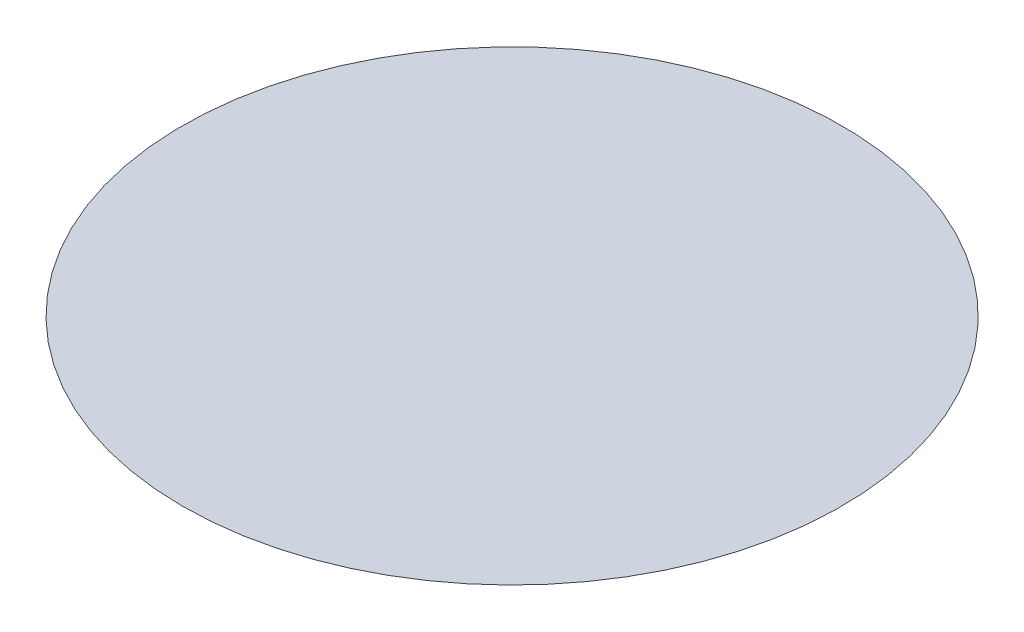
from build123d import *

# Parameters (mm, degrees)
SKETCH1_W          = 41.300685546
SKETCH1_H          = 2
BASE_EXTRUDE_DEPTH = 25
FILLET1_R          = 10
SKETCH4_W          = 50
SKETCH4_H          = 2
CUT_EXTRUDE1_DEPTH = 49.536034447


with BuildPart() as part:
    # Sketch1 → Base-Extrude (new, symmetric)
    with BuildSketch(Plane.XY):
        with Locations((0, 1)):
            Rectangle(SKETCH1_W, SKETCH1_H)
    extrude(amount=BASE_EXTRUDE_DEPTH, both=True)

    # Sketch5 → Boss-Revolve1 (revolve)
    with BuildSketch(Plane.XY, mode=Mode.PRIVATE) as boss_revolve1_sk:
        with BuildLine():
            Line((16.583123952, 0), (0, 0))
            Line((0, 0), (0, -5))
            ThreePointArc((0, -5), (8.660254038, -3.722813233), (16.583123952, 0))
        make_face()
    revolve(boss_revolve1_sk.sketch.rotate(Axis((0, 10.161735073, 0), (0, -1, 0)), 180), axis=Axis((0, 10.161735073, 0), (0, -1, 0)))

    # Fillet1
    fillet1_edges = [part.edges().sort_by_distance(p)[0] for p in [
        (16.583123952, 0, 0),
    ]]
    fillet(fillet1_edges, radius=FILLET1_R)

    # Sketch4 → Cut-Extrude1 (cut, through all)
    with BuildSketch(Plane(origin=(20.650342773, 0, 0), x_dir=(0, 0, -1), z_dir=(1, 0, 0))):
        with Locations((0, 1)):
            Rectangle(SKETCH4_W, SKETCH4_H)
    extrude(amount=-CUT_EXTRUDE1_DEPTH, mode=Mode.SUBTRACT)


solid = part.part
